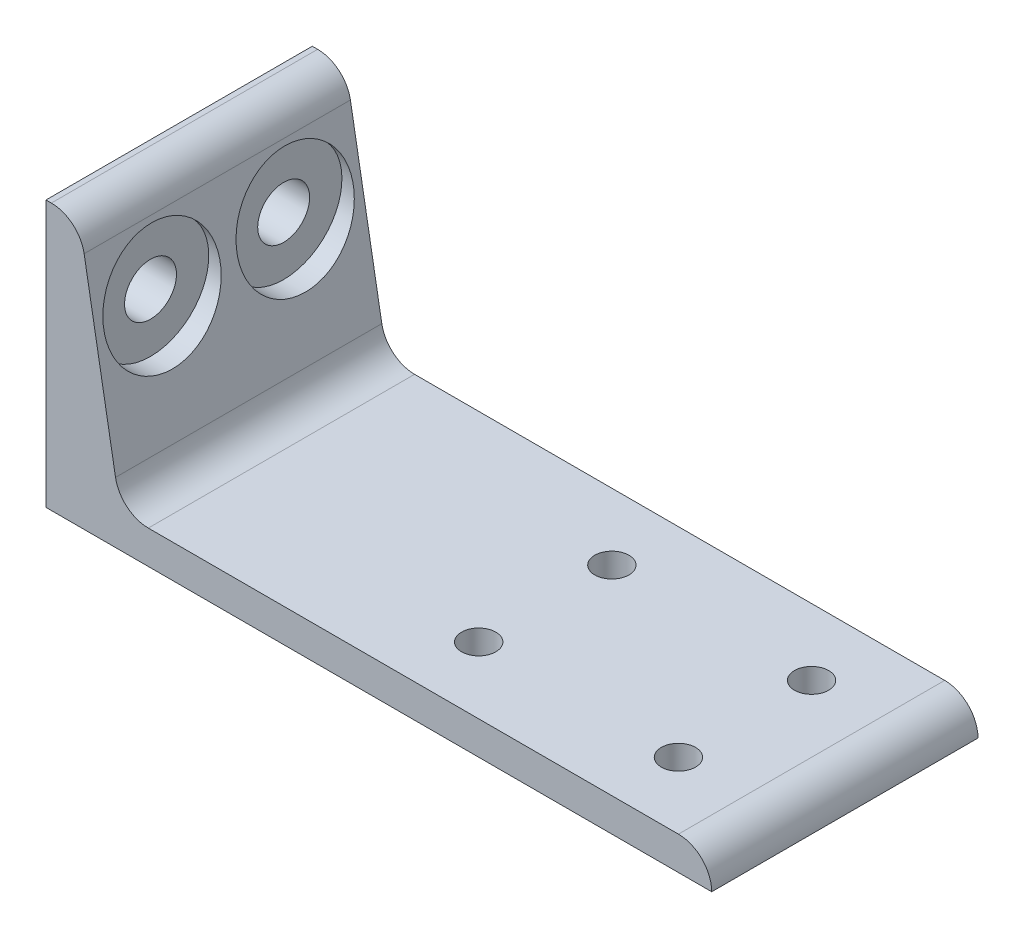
ISO-10303-21;
HEADER;
FILE_DESCRIPTION(('STEP AP214'),'2;1');
FILE_NAME('part.step','',(''),(''),'','','');
FILE_SCHEMA(('AUTOMOTIVE_DESIGN { 1 0 10303 214 1 1 1 1 }'));
ENDSEC;
DATA;
#1=APPLICATION_CONTEXT('core data for automotive mechanical design processes');
#2=APPLICATION_PROTOCOL_DEFINITION('international standard','automotive_design',2000,#1);
#3=PRODUCT_CONTEXT('',#1,'mechanical');
#4=PRODUCT('Part','Part','',(#3));
#5=PRODUCT_RELATED_PRODUCT_CATEGORY('part','',(#4));
#6=PRODUCT_DEFINITION_FORMATION('','',#4);
#7=PRODUCT_DEFINITION_CONTEXT('part definition',#1,'design');
#8=PRODUCT_DEFINITION('design','',#6,#7);
#9=PRODUCT_DEFINITION_SHAPE('','',#8);
#10=(LENGTH_UNIT() NAMED_UNIT(*) SI_UNIT(.MILLI.,.METRE.));
#11=(NAMED_UNIT(*) PLANE_ANGLE_UNIT() SI_UNIT($,.RADIAN.));
#12=(NAMED_UNIT(*) SI_UNIT($,.STERADIAN.) SOLID_ANGLE_UNIT());
#13=UNCERTAINTY_MEASURE_WITH_UNIT(LENGTH_MEASURE(1.E-05),#10,'distance_accuracy_value','');
#14=(GEOMETRIC_REPRESENTATION_CONTEXT(3) GLOBAL_UNCERTAINTY_ASSIGNED_CONTEXT((#13)) GLOBAL_UNIT_ASSIGNED_CONTEXT((#10,
#11,#12)) REPRESENTATION_CONTEXT('',''));
#15=CARTESIAN_POINT('',(0.,0.,0.));
#16=DIRECTION('',(0.,0.,1.));
#17=DIRECTION('',(1.,0.,0.));
#18=AXIS2_PLACEMENT_3D('',#15,#16,#17);
#19=CARTESIAN_POINT('',(13.2624877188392,11.597334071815,25.4));
#20=DIRECTION('',(-0.984807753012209,-0.173648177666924,0.));
#21=DIRECTION('',(0.173648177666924,-0.984807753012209,0.));
#22=AXIS2_PLACEMENT_3D('',#19,#20,#21);
#23=PLANE('',#22);
#24=CARTESIAN_POINT('',(9.43134925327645,33.3248,12.7));
#25=DIRECTION('',(-0.984807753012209,-0.173648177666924,0.));
#26=DIRECTION('',(0.173648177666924,-0.984807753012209,0.));
#27=AXIS2_PLACEMENT_3D('',#24,#25,#26);
#28=ELLIPSE('',#27,11.2839282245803,11.1125);
#29=CARTESIAN_POINT('',(11.3907828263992,22.2123,12.7));
#30=VERTEX_POINT('',#29);
#31=EDGE_CURVE('E166',#30,#30,#28,.F.);
#32=ORIENTED_EDGE('',*,*,#31,.F.);
#33=EDGE_LOOP('',(#32));
#34=FACE_BOUND('',#33,.T.);
#35=DIRECTION('',(-0.173648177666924,0.984807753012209,0.));
#36=VECTOR('',#35,1.);
#37=CARTESIAN_POINT('',(13.2624877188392,11.597334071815,-25.4));
#38=LINE('',#37,#36);
#39=CARTESIAN_POINT('',(13.2624877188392,11.597334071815,-25.4));
#40=VERTEX_POINT('',#39);
#41=CARTESIAN_POINT('',(7.27524657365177,45.552665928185,-25.4));
#42=VERTEX_POINT('',#41);
#43=EDGE_CURVE('E127',#40,#42,#38,.T.);
#44=ORIENTED_EDGE('',*,*,#43,.T.);
#45=DIRECTION('',(0.,0.,-1.));
#46=VECTOR('',#45,1.);
#47=CARTESIAN_POINT('',(7.27524657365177,45.552665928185,25.4));
#48=LINE('',#47,#46);
#49=CARTESIAN_POINT('',(7.27524657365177,45.552665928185,25.4));
#50=VERTEX_POINT('',#49);
#51=EDGE_CURVE('E150',#50,#42,#48,.T.);
#52=ORIENTED_EDGE('',*,*,#51,.F.);
#53=DIRECTION('',(-0.173648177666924,0.984807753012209,0.));
#54=VECTOR('',#53,1.);
#55=CARTESIAN_POINT('',(13.2624877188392,11.597334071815,25.4));
#56=LINE('',#55,#54);
#57=CARTESIAN_POINT('',(13.2624877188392,11.597334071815,25.4));
#58=VERTEX_POINT('',#57);
#59=EDGE_CURVE('E142',#58,#50,#56,.T.);
#60=ORIENTED_EDGE('',*,*,#59,.F.);
#61=DIRECTION('',(0.,0.,-1.));
#62=VECTOR('',#61,1.);
#63=CARTESIAN_POINT('',(13.2624877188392,11.597334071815,25.4));
#64=LINE('',#63,#62);
#65=EDGE_CURVE('E153',#58,#40,#64,.T.);
#66=ORIENTED_EDGE('',*,*,#65,.T.);
#67=EDGE_LOOP('',(#44,#52,#60,#66));
#68=FACE_BOUND('',#67,.T.);
#69=CARTESIAN_POINT('',(9.43134925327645,33.3248,-12.7));
#70=DIRECTION('',(-0.984807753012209,-0.173648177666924,0.));
#71=DIRECTION('',(0.173648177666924,-0.984807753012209,0.));
#72=AXIS2_PLACEMENT_3D('',#69,#70,#71);
#73=ELLIPSE('',#72,11.2839282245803,11.1125);
#74=CARTESIAN_POINT('',(11.3907828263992,22.2123,-12.7));
#75=VERTEX_POINT('',#74);
#76=EDGE_CURVE('E34',#75,#75,#73,.F.);
#77=ORIENTED_EDGE('',*,*,#76,.F.);
#78=EDGE_LOOP('',(#77));
#79=FACE_BOUND('',#78,.T.);
#80=ADVANCED_FACE('F30',(#34,#68,#79),#23,.F.);
#81=CARTESIAN_POINT('',(0.,50.8,25.4));
#82=DIRECTION('',(1.,0.,0.));
#83=DIRECTION('',(0.,1.,0.));
#84=AXIS2_PLACEMENT_3D('',#81,#82,#83);
#85=PLANE('',#84);
#86=CARTESIAN_POINT('',(0.,33.3248,-12.7));
#87=DIRECTION('',(-1.,0.,0.));
#88=DIRECTION('',(0.,-1.,0.));
#89=AXIS2_PLACEMENT_3D('',#86,#87,#88);
#90=CIRCLE('',#89,4.953);
#91=CARTESIAN_POINT('',(0.,28.3718,-12.7));
#92=VERTEX_POINT('',#91);
#93=EDGE_CURVE('E176',#92,#92,#90,.T.);
#94=ORIENTED_EDGE('',*,*,#93,.F.);
#95=EDGE_LOOP('',(#94));
#96=FACE_BOUND('',#95,.T.);
#97=CARTESIAN_POINT('',(0.,33.3248,12.7));
#98=DIRECTION('',(-1.,0.,0.));
#99=DIRECTION('',(0.,-1.,0.));
#100=AXIS2_PLACEMENT_3D('',#97,#98,#99);
#101=CIRCLE('',#100,4.953);
#102=CARTESIAN_POINT('',(0.,28.3718,12.7));
#103=VERTEX_POINT('',#102);
#104=EDGE_CURVE('E169',#103,#103,#101,.T.);
#105=ORIENTED_EDGE('',*,*,#104,.F.);
#106=EDGE_LOOP('',(#105));
#107=FACE_BOUND('',#106,.T.);
#108=DIRECTION('',(0.,-1.,0.));
#109=VECTOR('',#108,1.);
#110=CARTESIAN_POINT('',(0.,50.8,-25.4));
#111=LINE('',#110,#109);
#112=CARTESIAN_POINT('',(0.,50.8,-25.4));
#113=VERTEX_POINT('',#112);
#114=CARTESIAN_POINT('',(0.,0.,-25.4));
#115=VERTEX_POINT('',#114);
#116=EDGE_CURVE('E101',#113,#115,#111,.T.);
#117=ORIENTED_EDGE('',*,*,#116,.T.);
#118=DIRECTION('',(0.,0.,-1.));
#119=VECTOR('',#118,1.);
#120=CARTESIAN_POINT('',(0.,0.,25.4));
#121=LINE('',#120,#119);
#122=CARTESIAN_POINT('',(0.,0.,25.4));
#123=VERTEX_POINT('',#122);
#124=EDGE_CURVE('E11',#123,#115,#121,.T.);
#125=ORIENTED_EDGE('',*,*,#124,.F.);
#126=DIRECTION('',(0.,-1.,0.));
#127=VECTOR('',#126,1.);
#128=CARTESIAN_POINT('',(0.,50.8,25.4));
#129=LINE('',#128,#127);
#130=CARTESIAN_POINT('',(0.,50.8,25.4));
#131=VERTEX_POINT('',#130);
#132=EDGE_CURVE('E133',#131,#123,#129,.T.);
#133=ORIENTED_EDGE('',*,*,#132,.F.);
#134=DIRECTION('',(0.,0.,-1.));
#135=VECTOR('',#134,1.);
#136=CARTESIAN_POINT('',(0.,50.8,25.4));
#137=LINE('',#136,#135);
#138=EDGE_CURVE('E114',#131,#113,#137,.T.);
#139=ORIENTED_EDGE('',*,*,#138,.T.);
#140=EDGE_LOOP('',(#117,#125,#133,#139));
#141=FACE_BOUND('',#140,.T.);
#142=ADVANCED_FACE('F32',(#96,#107,#141),#85,.F.);
#143=CARTESIAN_POINT('',(0.,0.,25.4));
#144=DIRECTION('',(0.,1.,0.));
#145=DIRECTION('',(0.,0.,1.));
#146=AXIS2_PLACEMENT_3D('',#143,#144,#145);
#147=PLANE('',#146);
#148=CARTESIAN_POINT('',(107.95,0.,-12.7));
#149=DIRECTION('',(0.,-1.,0.));
#150=DIRECTION('',(0.,0.,-1.));
#151=AXIS2_PLACEMENT_3D('',#148,#149,#150);
#152=CIRCLE('',#151,3.26389999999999);
#153=CARTESIAN_POINT('',(107.95,0.,-15.9639));
#154=VERTEX_POINT('',#153);
#155=EDGE_CURVE('E184',#154,#154,#152,.T.);
#156=ORIENTED_EDGE('',*,*,#155,.F.);
#157=EDGE_LOOP('',(#156));
#158=FACE_BOUND('',#157,.T.);
#159=CARTESIAN_POINT('',(69.85,0.,-12.7));
#160=DIRECTION('',(0.,-1.,0.));
#161=DIRECTION('',(0.,0.,-1.));
#162=AXIS2_PLACEMENT_3D('',#159,#160,#161);
#163=CIRCLE('',#162,3.26389999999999);
#164=CARTESIAN_POINT('',(69.85,0.,-15.9639));
#165=VERTEX_POINT('',#164);
#166=EDGE_CURVE('E190',#165,#165,#163,.T.);
#167=ORIENTED_EDGE('',*,*,#166,.F.);
#168=EDGE_LOOP('',(#167));
#169=FACE_BOUND('',#168,.T.);
#170=CARTESIAN_POINT('',(69.85,0.,12.7));
#171=DIRECTION('',(0.,-1.,0.));
#172=DIRECTION('',(0.,0.,-1.));
#173=AXIS2_PLACEMENT_3D('',#170,#171,#172);
#174=CIRCLE('',#173,3.26389999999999);
#175=CARTESIAN_POINT('',(69.85,0.,9.43610000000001));
#176=VERTEX_POINT('',#175);
#177=EDGE_CURVE('E200',#176,#176,#174,.T.);
#178=ORIENTED_EDGE('',*,*,#177,.F.);
#179=EDGE_LOOP('',(#178));
#180=FACE_BOUND('',#179,.T.);
#181=CARTESIAN_POINT('',(107.95,0.,12.7));
#182=DIRECTION('',(0.,-1.,0.));
#183=DIRECTION('',(0.,0.,-1.));
#184=AXIS2_PLACEMENT_3D('',#181,#182,#183);
#185=CIRCLE('',#184,3.26389999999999);
#186=CARTESIAN_POINT('',(107.95,0.,9.43610000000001));
#187=VERTEX_POINT('',#186);
#188=EDGE_CURVE('E118',#187,#187,#185,.T.);
#189=ORIENTED_EDGE('',*,*,#188,.F.);
#190=EDGE_LOOP('',(#189));
#191=FACE_BOUND('',#190,.T.);
#192=DIRECTION('',(1.,0.,0.));
#193=VECTOR('',#192,1.);
#194=CARTESIAN_POINT('',(0.,0.,-25.4));
#195=LINE('',#194,#193);
#196=CARTESIAN_POINT('',(127.,0.,-25.4));
#197=VERTEX_POINT('',#196);
#198=EDGE_CURVE('E97',#115,#197,#195,.T.);
#199=ORIENTED_EDGE('',*,*,#198,.T.);
#200=DIRECTION('',(0.,0.,-1.));
#201=VECTOR('',#200,1.);
#202=CARTESIAN_POINT('',(127.,0.,25.4));
#203=LINE('',#202,#201);
#204=CARTESIAN_POINT('',(127.,0.,25.4));
#205=VERTEX_POINT('',#204);
#206=EDGE_CURVE('E39',#205,#197,#203,.T.);
#207=ORIENTED_EDGE('',*,*,#206,.F.);
#208=DIRECTION('',(1.,0.,0.));
#209=VECTOR('',#208,1.);
#210=CARTESIAN_POINT('',(0.,0.,25.4));
#211=LINE('',#210,#209);
#212=EDGE_CURVE('E110',#123,#205,#211,.T.);
#213=ORIENTED_EDGE('',*,*,#212,.F.);
#214=ORIENTED_EDGE('',*,*,#124,.T.);
#215=EDGE_LOOP('',(#199,#207,#213,#214));
#216=FACE_BOUND('',#215,.T.);
#217=ADVANCED_FACE('F109',(#158,#169,#180,#191,#216),#147,.F.);
#218=CARTESIAN_POINT('',(120.65,0.,25.4));
#219=DIRECTION('',(0.,0.,-1.));
#220=DIRECTION('',(-1.,0.,0.));
#221=AXIS2_PLACEMENT_3D('',#218,#219,#220);
#222=CYLINDRICAL_SURFACE('',#221,6.34999999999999);
#223=CARTESIAN_POINT('',(120.65,0.,-25.4));
#224=DIRECTION('',(0.,0.,1.));
#225=DIRECTION('',(1.,0.,0.));
#226=AXIS2_PLACEMENT_3D('',#223,#224,#225);
#227=CIRCLE('',#226,6.34999999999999);
#228=CARTESIAN_POINT('',(120.65,6.34999999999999,-25.4));
#229=VERTEX_POINT('',#228);
#230=EDGE_CURVE('E103',#197,#229,#227,.T.);
#231=ORIENTED_EDGE('',*,*,#230,.T.);
#232=DIRECTION('',(0.,0.,-1.));
#233=VECTOR('',#232,1.);
#234=CARTESIAN_POINT('',(120.65,6.34999999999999,25.4));
#235=LINE('',#234,#233);
#236=CARTESIAN_POINT('',(120.65,6.34999999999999,25.4));
#237=VERTEX_POINT('',#236);
#238=EDGE_CURVE('E159',#237,#229,#235,.T.);
#239=ORIENTED_EDGE('',*,*,#238,.F.);
#240=CARTESIAN_POINT('',(120.65,0.,25.4));
#241=DIRECTION('',(0.,0.,1.));
#242=DIRECTION('',(1.,0.,0.));
#243=AXIS2_PLACEMENT_3D('',#240,#241,#242);
#244=CIRCLE('',#243,6.34999999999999);
#245=EDGE_CURVE('E136',#205,#237,#244,.T.);
#246=ORIENTED_EDGE('',*,*,#245,.F.);
#247=ORIENTED_EDGE('',*,*,#206,.T.);
#248=EDGE_LOOP('',(#231,#239,#246,#247));
#249=FACE_BOUND('',#248,.T.);
#250=ADVANCED_FACE('F212',(#249),#222,.T.);
#251=CARTESIAN_POINT('',(120.65,6.34999999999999,25.4));
#252=DIRECTION('',(0.,-1.,0.));
#253=DIRECTION('',(1.,0.,0.));
#254=AXIS2_PLACEMENT_3D('',#251,#252,#253);
#255=PLANE('',#254);
#256=CARTESIAN_POINT('',(107.95,6.34999999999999,-12.7));
#257=DIRECTION('',(0.,-1.,0.));
#258=DIRECTION('',(1.,0.,0.));
#259=AXIS2_PLACEMENT_3D('',#256,#257,#258);
#260=CIRCLE('',#259,3.26389999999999);
#261=CARTESIAN_POINT('',(111.2139,6.35,-12.7));
#262=VERTEX_POINT('',#261);
#263=EDGE_CURVE('E187',#262,#262,#260,.F.);
#264=ORIENTED_EDGE('',*,*,#263,.F.);
#265=EDGE_LOOP('',(#264));
#266=FACE_BOUND('',#265,.T.);
#267=CARTESIAN_POINT('',(69.85,6.34999999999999,-12.7));
#268=DIRECTION('',(0.,-1.,0.));
#269=DIRECTION('',(1.,0.,0.));
#270=AXIS2_PLACEMENT_3D('',#267,#268,#269);
#271=CIRCLE('',#270,3.26389999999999);
#272=CARTESIAN_POINT('',(73.1139,6.34999999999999,-12.7));
#273=VERTEX_POINT('',#272);
#274=EDGE_CURVE('E193',#273,#273,#271,.F.);
#275=ORIENTED_EDGE('',*,*,#274,.F.);
#276=EDGE_LOOP('',(#275));
#277=FACE_BOUND('',#276,.T.);
#278=CARTESIAN_POINT('',(69.85,6.34999999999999,12.7));
#279=DIRECTION('',(0.,-1.,0.));
#280=DIRECTION('',(1.,0.,0.));
#281=AXIS2_PLACEMENT_3D('',#278,#279,#280);
#282=CIRCLE('',#281,3.26389999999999);
#283=CARTESIAN_POINT('',(73.1139,6.34999999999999,12.7));
#284=VERTEX_POINT('',#283);
#285=EDGE_CURVE('E203',#284,#284,#282,.F.);
#286=ORIENTED_EDGE('',*,*,#285,.F.);
#287=EDGE_LOOP('',(#286));
#288=FACE_BOUND('',#287,.T.);
#289=CARTESIAN_POINT('',(107.95,6.34999999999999,12.7));
#290=DIRECTION('',(0.,-1.,0.));
#291=DIRECTION('',(1.,0.,0.));
#292=AXIS2_PLACEMENT_3D('',#289,#290,#291);
#293=CIRCLE('',#292,3.26389999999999);
#294=CARTESIAN_POINT('',(111.2139,6.35,12.7));
#295=VERTEX_POINT('',#294);
#296=EDGE_CURVE('E115',#295,#295,#293,.F.);
#297=ORIENTED_EDGE('',*,*,#296,.F.);
#298=EDGE_LOOP('',(#297));
#299=FACE_BOUND('',#298,.T.);
#300=DIRECTION('',(-1.,0.,0.));
#301=VECTOR('',#300,1.);
#302=CARTESIAN_POINT('',(120.65,6.34999999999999,-25.4));
#303=LINE('',#302,#301);
#304=CARTESIAN_POINT('',(19.5160169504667,6.34999999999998,-25.4));
#305=VERTEX_POINT('',#304);
#306=EDGE_CURVE('E123',#229,#305,#303,.T.);
#307=ORIENTED_EDGE('',*,*,#306,.T.);
#308=DIRECTION('',(0.,0.,-1.));
#309=VECTOR('',#308,1.);
#310=CARTESIAN_POINT('',(19.5160169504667,6.34999999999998,25.4));
#311=LINE('',#310,#309);
#312=CARTESIAN_POINT('',(19.5160169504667,6.34999999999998,25.4));
#313=VERTEX_POINT('',#312);
#314=EDGE_CURVE('E156',#313,#305,#311,.T.);
#315=ORIENTED_EDGE('',*,*,#314,.F.);
#316=DIRECTION('',(-1.,0.,0.));
#317=VECTOR('',#316,1.);
#318=CARTESIAN_POINT('',(120.65,6.34999999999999,25.4));
#319=LINE('',#318,#317);
#320=EDGE_CURVE('E138',#237,#313,#319,.T.);
#321=ORIENTED_EDGE('',*,*,#320,.F.);
#322=ORIENTED_EDGE('',*,*,#238,.T.);
#323=EDGE_LOOP('',(#307,#315,#321,#322));
#324=FACE_BOUND('',#323,.T.);
#325=ADVANCED_FACE('F218',(#266,#277,#288,#299,#324),#255,.F.);
#326=CARTESIAN_POINT('',(19.5160169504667,12.7,25.4));
#327=DIRECTION('',(0.,0.,-1.));
#328=DIRECTION('',(-1.,0.,0.));
#329=AXIS2_PLACEMENT_3D('',#326,#327,#328);
#330=CYLINDRICAL_SURFACE('',#329,6.34999999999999);
#331=CARTESIAN_POINT('',(19.5160169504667,12.7,-25.4));
#332=DIRECTION('',(0.,0.,-1.));
#333=DIRECTION('',(-1.,0.,0.));
#334=AXIS2_PLACEMENT_3D('',#331,#332,#333);
#335=CIRCLE('',#334,6.34999999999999);
#336=EDGE_CURVE('E125',#305,#40,#335,.T.);
#337=ORIENTED_EDGE('',*,*,#336,.T.);
#338=ORIENTED_EDGE('',*,*,#65,.F.);
#339=CARTESIAN_POINT('',(19.5160169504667,12.7,25.4));
#340=DIRECTION('',(0.,0.,-1.));
#341=DIRECTION('',(-1.,0.,0.));
#342=AXIS2_PLACEMENT_3D('',#339,#340,#341);
#343=CIRCLE('',#342,6.34999999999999);
#344=EDGE_CURVE('E140',#313,#58,#343,.T.);
#345=ORIENTED_EDGE('',*,*,#344,.F.);
#346=ORIENTED_EDGE('',*,*,#314,.T.);
#347=EDGE_LOOP('',(#337,#338,#345,#346));
#348=FACE_BOUND('',#347,.T.);
#349=ADVANCED_FACE('F235',(#348),#330,.F.);
#350=CARTESIAN_POINT('',(1.02171734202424,44.45,25.4));
#351=DIRECTION('',(0.,0.,-1.));
#352=DIRECTION('',(-1.,0.,0.));
#353=AXIS2_PLACEMENT_3D('',#350,#351,#352);
#354=CYLINDRICAL_SURFACE('',#353,6.35);
#355=CARTESIAN_POINT('',(1.02171734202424,44.45,-25.4));
#356=DIRECTION('',(0.,0.,1.));
#357=DIRECTION('',(1.,0.,0.));
#358=AXIS2_PLACEMENT_3D('',#355,#356,#357);
#359=CIRCLE('',#358,6.35);
#360=CARTESIAN_POINT('',(1.02171734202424,50.8,-25.4));
#361=VERTEX_POINT('',#360);
#362=EDGE_CURVE('E129',#42,#361,#359,.T.);
#363=ORIENTED_EDGE('',*,*,#362,.T.);
#364=DIRECTION('',(0.,0.,-1.));
#365=VECTOR('',#364,1.);
#366=CARTESIAN_POINT('',(1.02171734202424,50.8,25.4));
#367=LINE('',#366,#365);
#368=CARTESIAN_POINT('',(1.02171734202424,50.8,25.4));
#369=VERTEX_POINT('',#368);
#370=EDGE_CURVE('E147',#369,#361,#367,.T.);
#371=ORIENTED_EDGE('',*,*,#370,.F.);
#372=CARTESIAN_POINT('',(1.02171734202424,44.45,25.4));
#373=DIRECTION('',(0.,0.,1.));
#374=DIRECTION('',(1.,0.,0.));
#375=AXIS2_PLACEMENT_3D('',#372,#373,#374);
#376=CIRCLE('',#375,6.35);
#377=EDGE_CURVE('E52',#50,#369,#376,.T.);
#378=ORIENTED_EDGE('',*,*,#377,.F.);
#379=ORIENTED_EDGE('',*,*,#51,.T.);
#380=EDGE_LOOP('',(#363,#371,#378,#379));
#381=FACE_BOUND('',#380,.T.);
#382=ADVANCED_FACE('F233',(#381),#354,.T.);
#383=CARTESIAN_POINT('',(1.02171734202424,50.8,25.4));
#384=DIRECTION('',(0.,-1.,0.));
#385=DIRECTION('',(0.,0.,-1.));
#386=AXIS2_PLACEMENT_3D('',#383,#384,#385);
#387=PLANE('',#386);
#388=DIRECTION('',(-1.,0.,0.));
#389=VECTOR('',#388,1.);
#390=CARTESIAN_POINT('',(1.02171734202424,50.8,-25.4));
#391=LINE('',#390,#389);
#392=EDGE_CURVE('E131',#361,#113,#391,.T.);
#393=ORIENTED_EDGE('',*,*,#392,.T.);
#394=ORIENTED_EDGE('',*,*,#138,.F.);
#395=DIRECTION('',(-1.,0.,0.));
#396=VECTOR('',#395,1.);
#397=CARTESIAN_POINT('',(1.02171734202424,50.8,25.4));
#398=LINE('',#397,#396);
#399=EDGE_CURVE('E47',#369,#131,#398,.T.);
#400=ORIENTED_EDGE('',*,*,#399,.F.);
#401=ORIENTED_EDGE('',*,*,#370,.T.);
#402=EDGE_LOOP('',(#393,#394,#400,#401));
#403=FACE_BOUND('',#402,.T.);
#404=ADVANCED_FACE('F264',(#403),#387,.F.);
#405=CARTESIAN_POINT('',(120.65,0.,25.4));
#406=DIRECTION('',(0.,0.,1.));
#407=DIRECTION('',(1.,0.,0.));
#408=AXIS2_PLACEMENT_3D('',#405,#406,#407);
#409=PLANE('',#408);
#410=ORIENTED_EDGE('',*,*,#132,.T.);
#411=ORIENTED_EDGE('',*,*,#212,.T.);
#412=ORIENTED_EDGE('',*,*,#245,.T.);
#413=ORIENTED_EDGE('',*,*,#320,.T.);
#414=ORIENTED_EDGE('',*,*,#344,.T.);
#415=ORIENTED_EDGE('',*,*,#59,.T.);
#416=ORIENTED_EDGE('',*,*,#377,.T.);
#417=ORIENTED_EDGE('',*,*,#399,.T.);
#418=EDGE_LOOP('',(#410,#411,#412,#413,#414,#415,#416,#417));
#419=FACE_BOUND('',#418,.T.);
#420=ADVANCED_FACE('F265',(#419),#409,.T.);
#421=CARTESIAN_POINT('',(120.65,0.,-25.4));
#422=DIRECTION('',(0.,0.,1.));
#423=DIRECTION('',(1.,0.,0.));
#424=AXIS2_PLACEMENT_3D('',#421,#422,#423);
#425=PLANE('',#424);
#426=ORIENTED_EDGE('',*,*,#116,.F.);
#427=ORIENTED_EDGE('',*,*,#392,.F.);
#428=ORIENTED_EDGE('',*,*,#362,.F.);
#429=ORIENTED_EDGE('',*,*,#43,.F.);
#430=ORIENTED_EDGE('',*,*,#336,.F.);
#431=ORIENTED_EDGE('',*,*,#306,.F.);
#432=ORIENTED_EDGE('',*,*,#230,.F.);
#433=ORIENTED_EDGE('',*,*,#198,.F.);
#434=EDGE_LOOP('',(#426,#427,#428,#429,#430,#431,#432,#433));
#435=FACE_BOUND('',#434,.T.);
#436=ADVANCED_FACE('F98',(#435),#425,.F.);
#437=CARTESIAN_POINT('',(107.95,50.801,12.7));
#438=DIRECTION('',(0.,-1.,0.));
#439=DIRECTION('',(0.,0.,-1.));
#440=AXIS2_PLACEMENT_3D('',#437,#438,#439);
#441=CYLINDRICAL_SURFACE('',#440,3.26389999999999);
#442=ORIENTED_EDGE('',*,*,#188,.T.);
#443=EDGE_LOOP('',(#442));
#444=FACE_BOUND('',#443,.T.);
#445=ORIENTED_EDGE('',*,*,#296,.T.);
#446=EDGE_LOOP('',(#445));
#447=FACE_BOUND('',#446,.T.);
#448=ADVANCED_FACE('F208',(#444,#447),#441,.F.);
#449=CARTESIAN_POINT('',(69.85,50.801,12.7));
#450=DIRECTION('',(0.,-1.,0.));
#451=DIRECTION('',(0.,0.,-1.));
#452=AXIS2_PLACEMENT_3D('',#449,#450,#451);
#453=CYLINDRICAL_SURFACE('',#452,3.26389999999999);
#454=ORIENTED_EDGE('',*,*,#177,.T.);
#455=EDGE_LOOP('',(#454));
#456=FACE_BOUND('',#455,.T.);
#457=ORIENTED_EDGE('',*,*,#285,.T.);
#458=EDGE_LOOP('',(#457));
#459=FACE_BOUND('',#458,.T.);
#460=ADVANCED_FACE('F277',(#456,#459),#453,.F.);
#461=CARTESIAN_POINT('',(127.001,33.3248,12.7));
#462=DIRECTION('',(-1.,0.,0.));
#463=DIRECTION('',(0.,-1.,0.));
#464=AXIS2_PLACEMENT_3D('',#461,#462,#463);
#465=CYLINDRICAL_SURFACE('',#464,4.953);
#466=CARTESIAN_POINT('',(7.23900000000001,33.3248,12.7));
#467=DIRECTION('',(-1.,0.,0.));
#468=DIRECTION('',(0.,-1.,0.));
#469=AXIS2_PLACEMENT_3D('',#466,#467,#468);
#470=CIRCLE('',#469,4.953);
#471=CARTESIAN_POINT('',(7.23900000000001,28.3718,12.7));
#472=VERTEX_POINT('',#471);
#473=EDGE_CURVE('E163',#472,#472,#470,.F.);
#474=ORIENTED_EDGE('',*,*,#473,.T.);
#475=EDGE_LOOP('',(#474));
#476=FACE_BOUND('',#475,.T.);
#477=ORIENTED_EDGE('',*,*,#104,.T.);
#478=EDGE_LOOP('',(#477));
#479=FACE_BOUND('',#478,.T.);
#480=ADVANCED_FACE('F280',(#476,#479),#465,.F.);
#481=CARTESIAN_POINT('',(7.239,33.3248,12.7));
#482=DIRECTION('',(1.,0.,0.));
#483=DIRECTION('',(0.,1.,0.));
#484=AXIS2_PLACEMENT_3D('',#481,#482,#483);
#485=CYLINDRICAL_SURFACE('',#484,11.1125);
#486=CARTESIAN_POINT('',(7.239,33.3248,12.7));
#487=DIRECTION('',(-1.,0.,0.));
#488=DIRECTION('',(0.,-1.,0.));
#489=AXIS2_PLACEMENT_3D('',#486,#487,#488);
#490=CIRCLE('',#489,11.1125);
#491=CARTESIAN_POINT('',(7.239,22.2123,12.7));
#492=VERTEX_POINT('',#491);
#493=EDGE_CURVE('E167',#492,#492,#490,.T.);
#494=ORIENTED_EDGE('',*,*,#493,.T.);
#495=EDGE_LOOP('',(#494));
#496=FACE_BOUND('',#495,.T.);
#497=ORIENTED_EDGE('',*,*,#31,.T.);
#498=EDGE_LOOP('',(#497));
#499=FACE_BOUND('',#498,.T.);
#500=ADVANCED_FACE('F284',(#496,#499),#485,.F.);
#501=CARTESIAN_POINT('',(7.239,33.3248,12.7));
#502=DIRECTION('',(-1.,0.,0.));
#503=DIRECTION('',(0.,-1.,0.));
#504=AXIS2_PLACEMENT_3D('',#501,#502,#503);
#505=PLANE('',#504);
#506=ORIENTED_EDGE('',*,*,#493,.F.);
#507=EDGE_LOOP('',(#506));
#508=FACE_BOUND('',#507,.T.);
#509=ORIENTED_EDGE('',*,*,#473,.F.);
#510=EDGE_LOOP('',(#509));
#511=FACE_BOUND('',#510,.T.);
#512=ADVANCED_FACE('F288',(#508,#511),#505,.F.);
#513=CARTESIAN_POINT('',(69.85,50.801,-12.7));
#514=DIRECTION('',(0.,-1.,0.));
#515=DIRECTION('',(0.,0.,-1.));
#516=AXIS2_PLACEMENT_3D('',#513,#514,#515);
#517=CYLINDRICAL_SURFACE('',#516,3.26389999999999);
#518=ORIENTED_EDGE('',*,*,#166,.T.);
#519=EDGE_LOOP('',(#518));
#520=FACE_BOUND('',#519,.T.);
#521=ORIENTED_EDGE('',*,*,#274,.T.);
#522=EDGE_LOOP('',(#521));
#523=FACE_BOUND('',#522,.T.);
#524=ADVANCED_FACE('F292',(#520,#523),#517,.F.);
#525=CARTESIAN_POINT('',(107.95,50.801,-12.7));
#526=DIRECTION('',(0.,-1.,0.));
#527=DIRECTION('',(0.,0.,-1.));
#528=AXIS2_PLACEMENT_3D('',#525,#526,#527);
#529=CYLINDRICAL_SURFACE('',#528,3.26389999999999);
#530=ORIENTED_EDGE('',*,*,#155,.T.);
#531=EDGE_LOOP('',(#530));
#532=FACE_BOUND('',#531,.T.);
#533=ORIENTED_EDGE('',*,*,#263,.T.);
#534=EDGE_LOOP('',(#533));
#535=FACE_BOUND('',#534,.T.);
#536=ADVANCED_FACE('F296',(#532,#535),#529,.F.);
#537=CARTESIAN_POINT('',(127.001,33.3248,-12.7));
#538=DIRECTION('',(-1.,0.,0.));
#539=DIRECTION('',(0.,-1.,0.));
#540=AXIS2_PLACEMENT_3D('',#537,#538,#539);
#541=CYLINDRICAL_SURFACE('',#540,4.953);
#542=CARTESIAN_POINT('',(7.23900000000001,33.3248,-12.7));
#543=DIRECTION('',(-1.,0.,0.));
#544=DIRECTION('',(0.,-1.,0.));
#545=AXIS2_PLACEMENT_3D('',#542,#543,#544);
#546=CIRCLE('',#545,4.953);
#547=CARTESIAN_POINT('',(7.23900000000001,28.3718,-12.7));
#548=VERTEX_POINT('',#547);
#549=EDGE_CURVE('E170',#548,#548,#546,.F.);
#550=ORIENTED_EDGE('',*,*,#549,.T.);
#551=EDGE_LOOP('',(#550));
#552=FACE_BOUND('',#551,.T.);
#553=ORIENTED_EDGE('',*,*,#93,.T.);
#554=EDGE_LOOP('',(#553));
#555=FACE_BOUND('',#554,.T.);
#556=ADVANCED_FACE('F300',(#552,#555),#541,.F.);
#557=CARTESIAN_POINT('',(7.239,33.3248,-12.7));
#558=DIRECTION('',(1.,0.,0.));
#559=DIRECTION('',(0.,1.,0.));
#560=AXIS2_PLACEMENT_3D('',#557,#558,#559);
#561=CYLINDRICAL_SURFACE('',#560,11.1125);
#562=CARTESIAN_POINT('',(7.239,33.3248,-12.7));
#563=DIRECTION('',(-1.,0.,0.));
#564=DIRECTION('',(0.,-1.,0.));
#565=AXIS2_PLACEMENT_3D('',#562,#563,#564);
#566=CIRCLE('',#565,11.1125);
#567=CARTESIAN_POINT('',(7.239,22.2123,-12.7));
#568=VERTEX_POINT('',#567);
#569=EDGE_CURVE('E172',#568,#568,#566,.T.);
#570=ORIENTED_EDGE('',*,*,#569,.T.);
#571=EDGE_LOOP('',(#570));
#572=FACE_BOUND('',#571,.T.);
#573=ORIENTED_EDGE('',*,*,#76,.T.);
#574=EDGE_LOOP('',(#573));
#575=FACE_BOUND('',#574,.T.);
#576=ADVANCED_FACE('F304',(#572,#575),#561,.F.);
#577=CARTESIAN_POINT('',(7.239,33.3248,-12.7));
#578=DIRECTION('',(-1.,0.,0.));
#579=DIRECTION('',(0.,-1.,0.));
#580=AXIS2_PLACEMENT_3D('',#577,#578,#579);
#581=PLANE('',#580);
#582=ORIENTED_EDGE('',*,*,#569,.F.);
#583=EDGE_LOOP('',(#582));
#584=FACE_BOUND('',#583,.T.);
#585=ORIENTED_EDGE('',*,*,#549,.F.);
#586=EDGE_LOOP('',(#585));
#587=FACE_BOUND('',#586,.T.);
#588=ADVANCED_FACE('F307',(#584,#587),#581,.F.);
#589=CLOSED_SHELL('',(#80,#142,#217,#250,#325,#349,#382,#404,#420,#436,#448,#460,#480,#500,#512,
#524,#536,#556,#576,#588));
#590=MANIFOLD_SOLID_BREP('B2',#589);
#591=ADVANCED_BREP_SHAPE_REPRESENTATION('',(#18,#590),#14);
#592=SHAPE_DEFINITION_REPRESENTATION(#9,#591);
ENDSEC;
END-ISO-10303-21;
